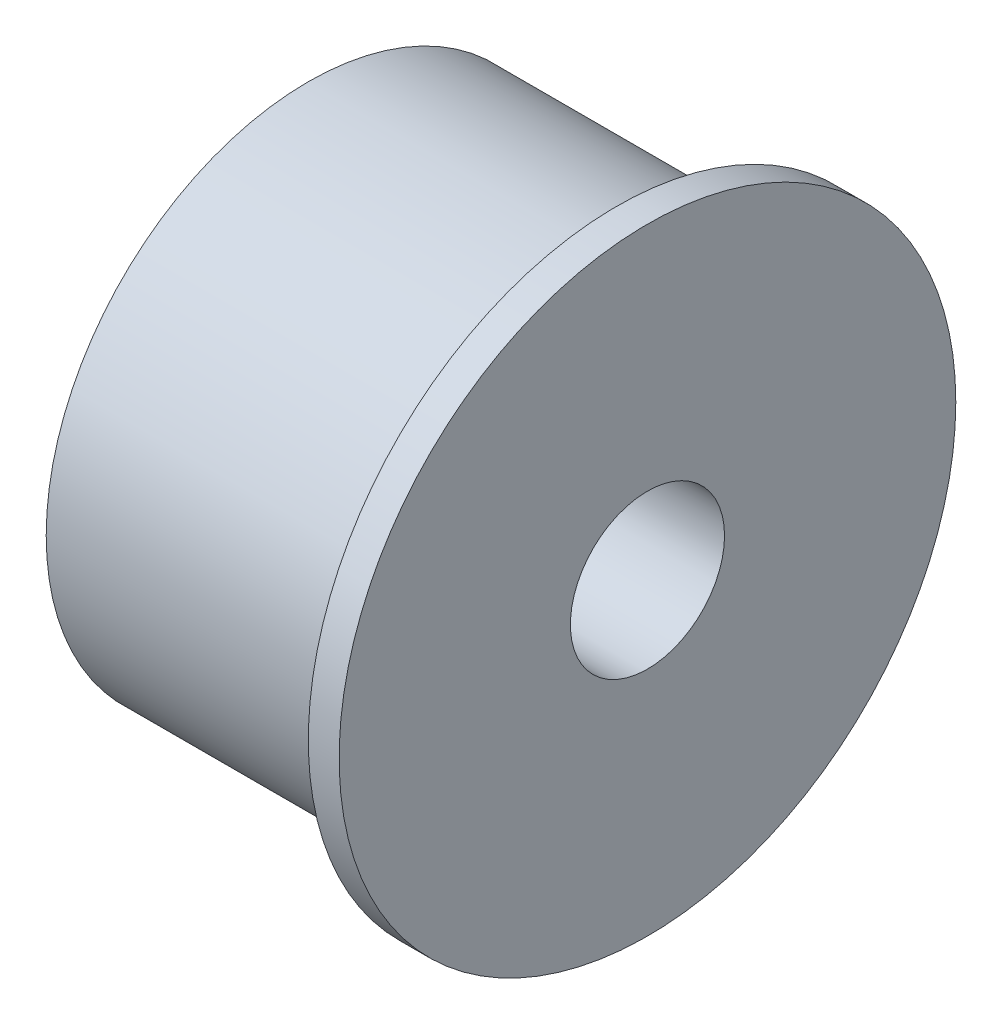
ISO-10303-21;
HEADER;
FILE_DESCRIPTION(('STEP AP214'),'2;1');
FILE_NAME('part.step','',(''),(''),'','','');
FILE_SCHEMA(('AUTOMOTIVE_DESIGN { 1 0 10303 214 1 1 1 1 }'));
ENDSEC;
DATA;
#1=APPLICATION_CONTEXT('core data for automotive mechanical design processes');
#2=APPLICATION_PROTOCOL_DEFINITION('international standard','automotive_design',2000,#1);
#3=PRODUCT_CONTEXT('',#1,'mechanical');
#4=PRODUCT('Part','Part','',(#3));
#5=PRODUCT_RELATED_PRODUCT_CATEGORY('part','',(#4));
#6=PRODUCT_DEFINITION_FORMATION('','',#4);
#7=PRODUCT_DEFINITION_CONTEXT('part definition',#1,'design');
#8=PRODUCT_DEFINITION('design','',#6,#7);
#9=PRODUCT_DEFINITION_SHAPE('','',#8);
#10=(LENGTH_UNIT() NAMED_UNIT(*) SI_UNIT(.MILLI.,.METRE.));
#11=(NAMED_UNIT(*) PLANE_ANGLE_UNIT() SI_UNIT($,.RADIAN.));
#12=(NAMED_UNIT(*) SI_UNIT($,.STERADIAN.) SOLID_ANGLE_UNIT());
#13=UNCERTAINTY_MEASURE_WITH_UNIT(LENGTH_MEASURE(1.E-05),#10,'distance_accuracy_value','');
#14=(GEOMETRIC_REPRESENTATION_CONTEXT(3) GLOBAL_UNCERTAINTY_ASSIGNED_CONTEXT((#13)) GLOBAL_UNIT_ASSIGNED_CONTEXT((#10,
#11,#12)) REPRESENTATION_CONTEXT('',''));
#15=CARTESIAN_POINT('',(0.,0.,0.));
#16=DIRECTION('',(0.,0.,1.));
#17=DIRECTION('',(1.,0.,0.));
#18=AXIS2_PLACEMENT_3D('',#15,#16,#17);
#19=CARTESIAN_POINT('',(-42.0843031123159,4.9999999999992,-1.63757896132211E-12));
#20=DIRECTION('',(1.,0.,0.));
#21=DIRECTION('',(0.,0.,-1.00000000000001));
#22=AXIS2_PLACEMENT_3D('',#19,#20,#21);
#23=PLANE('',#22);
#24=CARTESIAN_POINT('',(-42.0843031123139,-7.21644966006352E-13,-1.38777878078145E-12));
#25=DIRECTION('',(1.,0.,0.));
#26=DIRECTION('',(0.,0.,-1.00000000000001));
#27=AXIS2_PLACEMENT_3D('',#24,#25,#26);
#28=CIRCLE('',#27,20.);
#29=CARTESIAN_POINT('',(-42.0843031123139,-8.43769498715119E-13,-20.0000000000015));
#30=VERTEX_POINT('',#29);
#31=EDGE_CURVE('E10',#30,#30,#28,.T.);
#32=ORIENTED_EDGE('',*,*,#31,.T.);
#33=EDGE_LOOP('',(#32));
#34=FACE_BOUND('',#33,.T.);
#35=CARTESIAN_POINT('',(-42.0843031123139,-7.21644966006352E-13,-1.38777878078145E-12));
#36=DIRECTION('',(1.,0.,0.));
#37=DIRECTION('',(0.,0.,-1.00000000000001));
#38=AXIS2_PLACEMENT_3D('',#35,#36,#37);
#39=CIRCLE('',#38,4.99999999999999);
#40=CARTESIAN_POINT('',(-42.0843031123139,-7.52176099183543E-13,-5.00000000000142));
#41=VERTEX_POINT('',#40);
#42=EDGE_CURVE('E51',#41,#41,#39,.T.);
#43=ORIENTED_EDGE('',*,*,#42,.F.);
#44=EDGE_LOOP('',(#43));
#45=FACE_BOUND('',#44,.T.);
#46=ADVANCED_FACE('F29',(#34,#45),#23,.T.);
#47=CARTESIAN_POINT('',(0.,0.,0.));
#48=DIRECTION('',(1.,0.,0.));
#49=DIRECTION('',(0.,0.,-1.00000000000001));
#50=AXIS2_PLACEMENT_3D('',#47,#48,#49);
#51=CYLINDRICAL_SURFACE('',#50,20.);
#52=CARTESIAN_POINT('',(-44.0843031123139,0.,-3.05311331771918E-13));
#53=DIRECTION('',(1.,0.,0.));
#54=DIRECTION('',(0.,0.,-1.00000000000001));
#55=AXIS2_PLACEMENT_3D('',#52,#53,#54);
#56=CIRCLE('',#55,20.);
#57=CARTESIAN_POINT('',(-44.0843031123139,-1.22124532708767E-13,-20.0000000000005));
#58=VERTEX_POINT('',#57);
#59=EDGE_CURVE('E35',#58,#58,#56,.T.);
#60=ORIENTED_EDGE('',*,*,#59,.T.);
#61=EDGE_LOOP('',(#60));
#62=FACE_BOUND('',#61,.T.);
#63=ORIENTED_EDGE('',*,*,#31,.F.);
#64=EDGE_LOOP('',(#63));
#65=FACE_BOUND('',#64,.T.);
#66=ADVANCED_FACE('F59',(#62,#65),#51,.T.);
#67=CARTESIAN_POINT('',(-44.0843031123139,20.0000000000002,-7.49400541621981E-13));
#68=DIRECTION('',(-1.,0.,0.));
#69=DIRECTION('',(0.,0.,1.00000000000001));
#70=AXIS2_PLACEMENT_3D('',#67,#68,#69);
#71=PLANE('',#70);
#72=CARTESIAN_POINT('',(-44.0843031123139,0.,-3.05311331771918E-13));
#73=DIRECTION('',(1.,0.,0.));
#74=DIRECTION('',(0.,0.,-1.00000000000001));
#75=AXIS2_PLACEMENT_3D('',#72,#73,#74);
#76=CIRCLE('',#75,17.);
#77=CARTESIAN_POINT('',(-44.0843031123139,-1.03805852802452E-13,-17.0000000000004));
#78=VERTEX_POINT('',#77);
#79=EDGE_CURVE('E39',#78,#78,#76,.T.);
#80=ORIENTED_EDGE('',*,*,#79,.T.);
#81=EDGE_LOOP('',(#80));
#82=FACE_BOUND('',#81,.T.);
#83=ORIENTED_EDGE('',*,*,#59,.F.);
#84=EDGE_LOOP('',(#83));
#85=FACE_BOUND('',#84,.T.);
#86=ADVANCED_FACE('F63',(#82,#85),#71,.T.);
#87=CARTESIAN_POINT('',(0.,0.,0.));
#88=DIRECTION('',(1.,0.,0.));
#89=DIRECTION('',(0.,0.,-1.00000000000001));
#90=AXIS2_PLACEMENT_3D('',#87,#88,#89);
#91=CYLINDRICAL_SURFACE('',#90,17.);
#92=CARTESIAN_POINT('',(-64.0843031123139,0.,-2.22044604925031E-13));
#93=DIRECTION('',(1.,0.,0.));
#94=DIRECTION('',(0.,0.,-1.00000000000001));
#95=AXIS2_PLACEMENT_3D('',#92,#93,#94);
#96=CIRCLE('',#95,17.);
#97=CARTESIAN_POINT('',(-64.0843031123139,0.,-17.0000000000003));
#98=VERTEX_POINT('',#97);
#99=EDGE_CURVE('E43',#98,#98,#96,.T.);
#100=ORIENTED_EDGE('',*,*,#99,.T.);
#101=EDGE_LOOP('',(#100));
#102=FACE_BOUND('',#101,.T.);
#103=ORIENTED_EDGE('',*,*,#79,.F.);
#104=EDGE_LOOP('',(#103));
#105=FACE_BOUND('',#104,.T.);
#106=ADVANCED_FACE('F67',(#102,#105),#91,.T.);
#107=CARTESIAN_POINT('',(-64.0843031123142,17.,1.66533453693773E-13));
#108=DIRECTION('',(-1.,0.,0.));
#109=DIRECTION('',(0.,0.,1.00000000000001));
#110=AXIS2_PLACEMENT_3D('',#107,#108,#109);
#111=PLANE('',#110);
#112=CARTESIAN_POINT('',(-64.0843031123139,0.,-2.22044604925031E-13));
#113=DIRECTION('',(1.,0.,0.));
#114=DIRECTION('',(0.,0.,-1.00000000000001));
#115=AXIS2_PLACEMENT_3D('',#112,#113,#114);
#116=CIRCLE('',#115,4.99999999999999);
#117=CARTESIAN_POINT('',(-64.0843031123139,0.,-5.00000000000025));
#118=VERTEX_POINT('',#117);
#119=EDGE_CURVE('E48',#118,#118,#116,.T.);
#120=ORIENTED_EDGE('',*,*,#119,.T.);
#121=EDGE_LOOP('',(#120));
#122=FACE_BOUND('',#121,.T.);
#123=ORIENTED_EDGE('',*,*,#99,.F.);
#124=EDGE_LOOP('',(#123));
#125=FACE_BOUND('',#124,.T.);
#126=ADVANCED_FACE('F74',(#122,#125),#111,.T.);
#127=CARTESIAN_POINT('',(0.,0.,0.));
#128=DIRECTION('',(1.,0.,0.));
#129=DIRECTION('',(0.,0.,-1.00000000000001));
#130=AXIS2_PLACEMENT_3D('',#127,#128,#129);
#131=CYLINDRICAL_SURFACE('',#130,4.99999999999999);
#132=ORIENTED_EDGE('',*,*,#42,.T.);
#133=EDGE_LOOP('',(#132));
#134=FACE_BOUND('',#133,.T.);
#135=ORIENTED_EDGE('',*,*,#119,.F.);
#136=EDGE_LOOP('',(#135));
#137=FACE_BOUND('',#136,.T.);
#138=ADVANCED_FACE('F55',(#134,#137),#131,.F.);
#139=CLOSED_SHELL('',(#46,#66,#86,#106,#126,#138));
#140=MANIFOLD_SOLID_BREP('B2',#139);
#141=ADVANCED_BREP_SHAPE_REPRESENTATION('',(#18,#140),#14);
#142=SHAPE_DEFINITION_REPRESENTATION(#9,#141);
ENDSEC;
END-ISO-10303-21;
